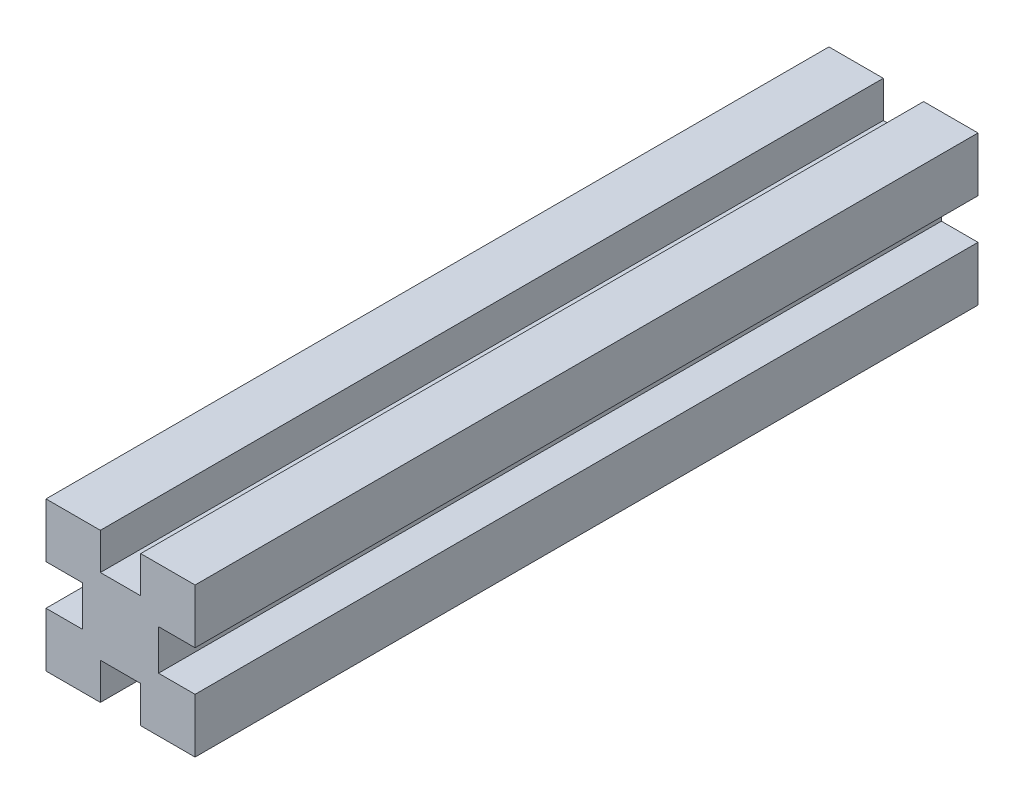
from build123d import *

# Parameters (mm, degrees)
AUFSATZ_LINEAR_AUSTRAGEN1_DEPTH = 167


with BuildPart() as part:
    # Skizze1 → Aufsatz-Linear austragen1 (new body)
    with BuildSketch(Plane.XY):
        Polygon((0, 0), (0, 11.6), (7.8, 11.6), (7.8, 20.2), (0, 20.2), (0, 31.8), (11.6, 31.8), (11.6, 24), (20.2, 24), (20.2, 31.8), (31.8, 31.8), (31.8, 20.2), (24, 20.2), (24, 11.6), (31.8, 11.6), (31.8, 0), (20.2, 0), (20.2, 7.8), (11.6, 7.8), (11.6, 0), align=None)
    extrude(amount=AUFSATZ_LINEAR_AUSTRAGEN1_DEPTH)


solid = part.part
